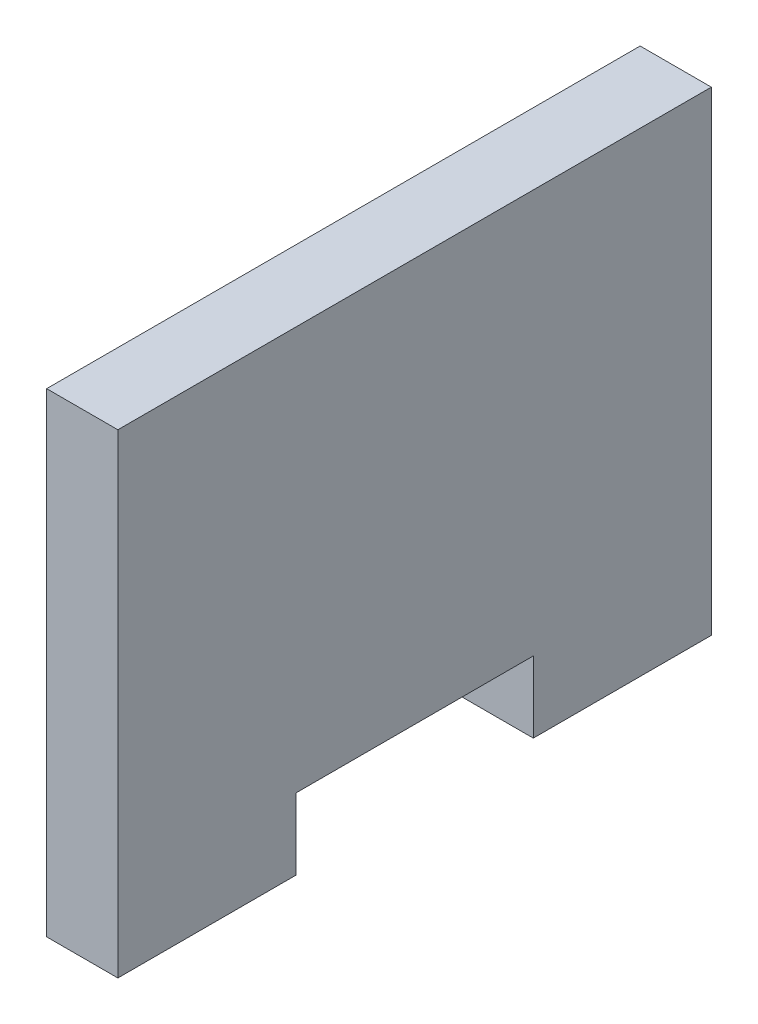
from build123d import *

# Parameters (mm, degrees)
BOSS_EXTRUDE1_DEPTH = 3


with BuildPart() as part:
    # Sketch1 → Boss-Extrude1 (new body)
    with BuildSketch(Plane(origin=(0, 0, 0), x_dir=(0, 0, -1), z_dir=(1, 0, 0))):
        Polygon((-31.957060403, 10.439101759), (-6.957060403, 10.439101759), (-6.957060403, -9.560898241), (-14.457060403, -9.560898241), (-14.457060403, -6.560898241), (-24.457060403, -6.560898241), (-24.457060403, -9.560898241), (-31.957060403, -9.560898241), align=None)
    extrude(amount=BOSS_EXTRUDE1_DEPTH)


solid = part.part
